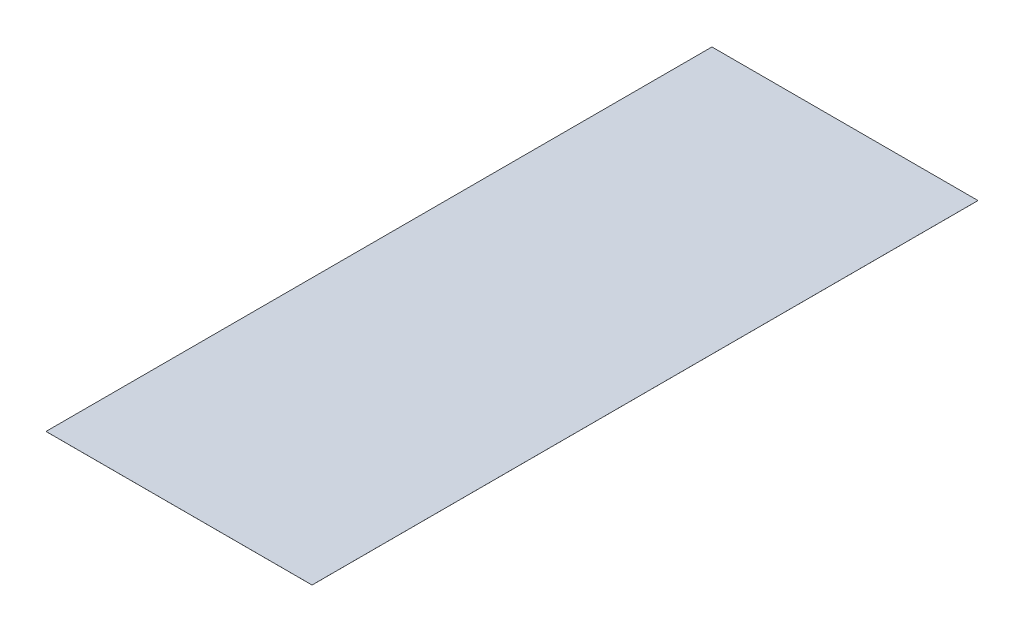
from build123d import *

# Parameters (mm, degrees)
ESQUISSE1_W        = 4000
ESQUISSE1_H        = 0.5
BOSS_EXTRU_1_DEPTH = 10012.49


with BuildPart() as part:
    # Esquisse1 → Boss.-Extru.1 (new body)
    with BuildSketch(Plane.XY):
        with Locations((0, 0.25)):
            Rectangle(ESQUISSE1_W, ESQUISSE1_H)
    extrude(amount=BOSS_EXTRU_1_DEPTH)


solid = part.part
